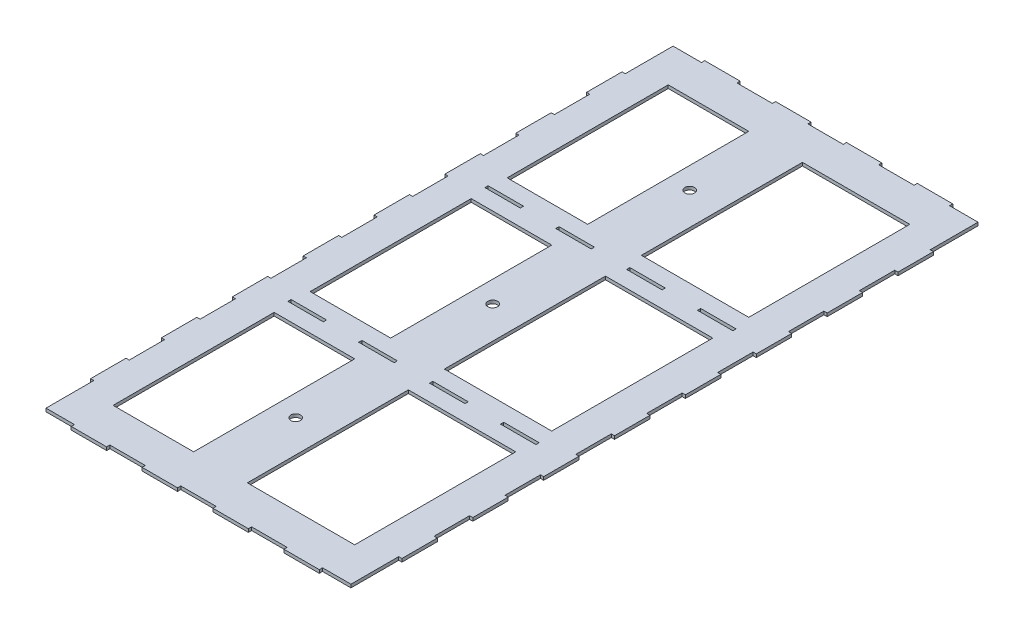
from build123d import *

# Parameters (mm, degrees)
SKETCH1_R           = 4.5
SKETCH1_W           = 33
SKETCH1_H           = 3
SKETCH1_W_2         = 100
SKETCH1_H_2         = 150
SKETCH1_W_3         = 75
BOSS_EXTRUDE1_DEPTH = 3


with BuildPart() as part:
    # Sketch1 → Boss-Extrude1 (new body)
    with BuildSketch(Plane(origin=(0, 0, 0), x_dir=(1, 0, 0), z_dir=(0, 1, 0))):
        Polygon((889, 590), (889, 545.5), (886, 545.5), (886, 512.5), (889, 512.5), (889, 479.5), (886, 479.5), (886, 446.5), (889, 446.5), (889, 413.5), (886, 413.5), (886, 380.5), (889, 380.5), (889, 347.5), (886, 347.5), (886, 314.5), (889, 314.5), (889, 281.5), (886, 281.5), (886, 248.5), (889, 248.5), (889, 215.5), (886, 215.5), (886, 182.5), (889, 182.5), (889, 149.5), (886, 149.5), (886, 116.5), (889, 116.5), (889, 83.5), (886, 83.5), (886, 50.5), (889, 50.5), (889, 17.5), (889, 6), (915.5, 6), (915.5, 3), (948.5, 3), (948.5, 6), (981.5, 6), (981.5, 3), (1014.5, 3), (1014.5, 6), (1047.5, 6), (1047.5, 3), (1080.5, 3), (1080.5, 6), (1113.5, 6), (1113.5, 3), (1146.5, 3), (1146.5, 6), (1173, 6), (1173, 50.5), (1176, 50.5), (1176, 83.5), (1173, 83.5), (1173, 116.5), (1176, 116.5), (1176, 149.5), (1173, 149.5), (1173, 182.5), (1176, 182.5), (1176, 215.5), (1173, 215.5), (1173, 248.5), (1176, 248.5), (1176, 281.5), (1173, 281.5), (1173, 314.5), (1176, 314.5), (1176, 347.5), (1173, 347.5), (1173, 380.5), (1176, 380.5), (1176, 413.5), (1173, 413.5), (1173, 446.5), (1176, 446.5), (1176, 479.5), (1173, 479.5), (1173, 512.5), (1176, 512.5), (1176, 545.5), (1173, 545.5), (1173, 578.5), (1173, 590), (1146.5, 590), (1146.5, 593), (1113.5, 593), (1113.5, 590), (1080.5, 590), (1080.5, 593), (1047.5, 593), (1047.5, 590), (1014.5, 590), (1014.5, 593), (981.5, 593), (981.5, 590), (948.5, 590), (948.5, 593), (915.5, 593), (915.5, 590), align=None)
        with Locations(Location((1013, 481.5, 0), (0, 0, 270))):
            Circle(SKETCH1_R, mode=Mode.SUBTRACT)
        with Locations(Location((1013, 298, 0), (0, 0, 270))):
            Circle(SKETCH1_R, mode=Mode.SUBTRACT)
        with Locations(Location((1013, 114.5, 0), (0, 0, 270))):
            Circle(SKETCH1_R, mode=Mode.SUBTRACT)
        with Locations((932, 206.25)):
            Rectangle(SKETCH1_W, SKETCH1_H, mode=Mode.SUBTRACT)
        with Locations((1093, 481.5)):
            Rectangle(SKETCH1_W_2, SKETCH1_H_2, mode=Mode.SUBTRACT)
        with Locations((1093, 298)):
            Rectangle(SKETCH1_W_2, SKETCH1_H_2, mode=Mode.SUBTRACT)
        with Locations((1093, 114.5)):
            Rectangle(SKETCH1_W_2, SKETCH1_H_2, mode=Mode.SUBTRACT)
        with Locations((955.5, 481.5)):
            Rectangle(SKETCH1_W_3, SKETCH1_H_2, mode=Mode.SUBTRACT)
        with Locations((955.5, 298)):
            Rectangle(SKETCH1_W_3, SKETCH1_H_2, mode=Mode.SUBTRACT)
        with Locations((955.5, 114.5)):
            Rectangle(SKETCH1_W_3, SKETCH1_H_2, mode=Mode.SUBTRACT)
        with Locations((932, 389.75)):
            Rectangle(SKETCH1_W, SKETCH1_H, mode=Mode.SUBTRACT)
        with Locations((998, 389.75)):
            Rectangle(SKETCH1_W, SKETCH1_H, mode=Mode.SUBTRACT)
        with Locations((1064, 389.75)):
            Rectangle(SKETCH1_W, SKETCH1_H, mode=Mode.SUBTRACT)
        with Locations((1130, 389.75)):
            Rectangle(SKETCH1_W, SKETCH1_H, mode=Mode.SUBTRACT)
        with Locations((998, 206.25)):
            Rectangle(SKETCH1_W, SKETCH1_H, mode=Mode.SUBTRACT)
        with Locations((1064, 206.25)):
            Rectangle(SKETCH1_W, SKETCH1_H, mode=Mode.SUBTRACT)
        with Locations((1130, 206.25)):
            Rectangle(SKETCH1_W, SKETCH1_H, mode=Mode.SUBTRACT)
    extrude(amount=BOSS_EXTRUDE1_DEPTH)


solid = part.part
